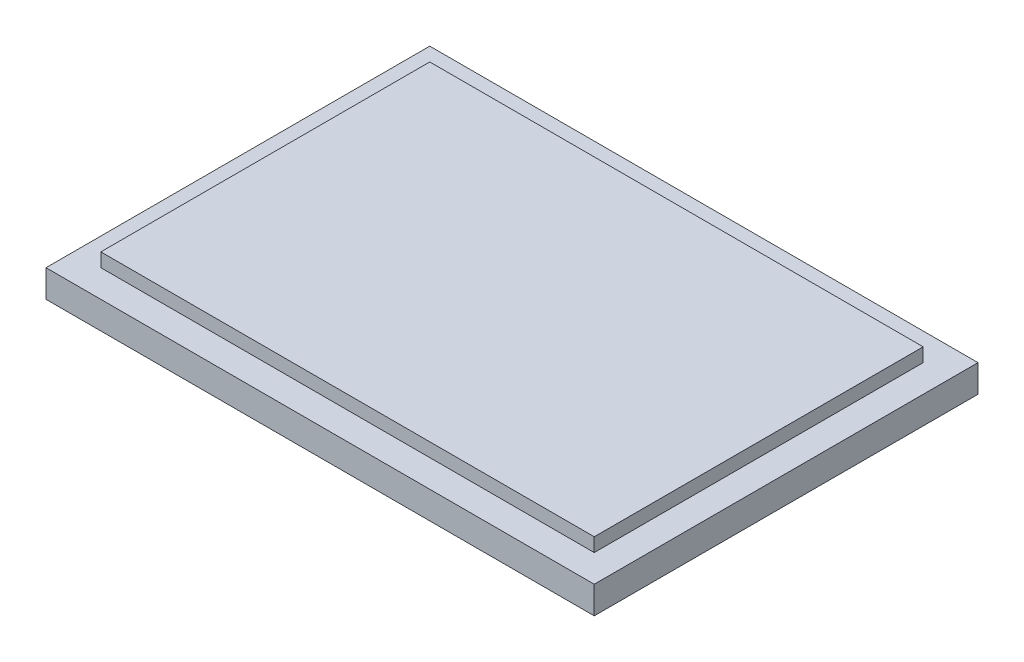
ISO-10303-21;
HEADER;
FILE_DESCRIPTION(('STEP AP214'),'2;1');
FILE_NAME('part.step','',(''),(''),'','','');
FILE_SCHEMA(('AUTOMOTIVE_DESIGN { 1 0 10303 214 1 1 1 1 }'));
ENDSEC;
DATA;
#1=APPLICATION_CONTEXT('core data for automotive mechanical design processes');
#2=APPLICATION_PROTOCOL_DEFINITION('international standard','automotive_design',2000,#1);
#3=PRODUCT_CONTEXT('',#1,'mechanical');
#4=PRODUCT('Part','Part','',(#3));
#5=PRODUCT_RELATED_PRODUCT_CATEGORY('part','',(#4));
#6=PRODUCT_DEFINITION_FORMATION('','',#4);
#7=PRODUCT_DEFINITION_CONTEXT('part definition',#1,'design');
#8=PRODUCT_DEFINITION('design','',#6,#7);
#9=PRODUCT_DEFINITION_SHAPE('','',#8);
#10=(LENGTH_UNIT() NAMED_UNIT(*) SI_UNIT(.MILLI.,.METRE.));
#11=(NAMED_UNIT(*) PLANE_ANGLE_UNIT() SI_UNIT($,.RADIAN.));
#12=(NAMED_UNIT(*) SI_UNIT($,.STERADIAN.) SOLID_ANGLE_UNIT());
#13=UNCERTAINTY_MEASURE_WITH_UNIT(LENGTH_MEASURE(1.E-05),#10,'distance_accuracy_value','');
#14=(GEOMETRIC_REPRESENTATION_CONTEXT(3) GLOBAL_UNCERTAINTY_ASSIGNED_CONTEXT((#13)) GLOBAL_UNIT_ASSIGNED_CONTEXT((#10,
#11,#12)) REPRESENTATION_CONTEXT('',''));
#15=CARTESIAN_POINT('',(0.,0.,0.));
#16=DIRECTION('',(0.,0.,1.));
#17=DIRECTION('',(1.,0.,0.));
#18=AXIS2_PLACEMENT_3D('',#15,#16,#17);
#19=CARTESIAN_POINT('',(-41.3182717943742,6.35,-25.2552133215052));
#20=DIRECTION('',(1.,0.,0.));
#21=DIRECTION('',(0.,0.,-1.));
#22=AXIS2_PLACEMENT_3D('',#19,#20,#21);
#23=PLANE('',#22);
#24=DIRECTION('',(0.,0.,1.));
#25=VECTOR('',#24,1.);
#26=CARTESIAN_POINT('',(-41.3182717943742,0.,-25.2552133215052));
#27=LINE('',#26,#25);
#28=CARTESIAN_POINT('',(-41.3182717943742,0.,-25.2552133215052));
#29=VERTEX_POINT('',#28);
#30=CARTESIAN_POINT('',(-41.3182717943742,0.,63.6447866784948));
#31=VERTEX_POINT('',#30);
#32=EDGE_CURVE('E120',#29,#31,#27,.T.);
#33=ORIENTED_EDGE('',*,*,#32,.T.);
#34=DIRECTION('',(0.,-1.,0.));
#35=VECTOR('',#34,1.);
#36=CARTESIAN_POINT('',(-41.3182717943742,6.35,63.6447866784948));
#37=LINE('',#36,#35);
#38=CARTESIAN_POINT('',(-41.3182717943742,6.35,63.6447866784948));
#39=VERTEX_POINT('',#38);
#40=EDGE_CURVE('E11',#39,#31,#37,.T.);
#41=ORIENTED_EDGE('',*,*,#40,.F.);
#42=DIRECTION('',(0.,0.,1.));
#43=VECTOR('',#42,1.);
#44=CARTESIAN_POINT('',(-41.3182717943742,6.35,-25.2552133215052));
#45=LINE('',#44,#43);
#46=CARTESIAN_POINT('',(-41.3182717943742,6.35,-25.2552133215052));
#47=VERTEX_POINT('',#46);
#48=EDGE_CURVE('E129',#47,#39,#45,.T.);
#49=ORIENTED_EDGE('',*,*,#48,.F.);
#50=DIRECTION('',(0.,-1.,0.));
#51=VECTOR('',#50,1.);
#52=CARTESIAN_POINT('',(-41.3182717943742,6.35,-25.2552133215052));
#53=LINE('',#52,#51);
#54=EDGE_CURVE('E138',#47,#29,#53,.T.);
#55=ORIENTED_EDGE('',*,*,#54,.T.);
#56=EDGE_LOOP('',(#33,#41,#49,#55));
#57=FACE_BOUND('',#56,.T.);
#58=ADVANCED_FACE('F36',(#57),#23,.F.);
#59=CARTESIAN_POINT('',(-41.3182717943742,6.35,63.6447866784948));
#60=DIRECTION('',(0.,0.,-1.));
#61=DIRECTION('',(-1.,0.,0.));
#62=AXIS2_PLACEMENT_3D('',#59,#60,#61);
#63=PLANE('',#62);
#64=DIRECTION('',(1.,0.,0.));
#65=VECTOR('',#64,1.);
#66=CARTESIAN_POINT('',(-41.3182717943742,0.,63.6447866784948));
#67=LINE('',#66,#65);
#68=CARTESIAN_POINT('',(85.6817282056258,0.,63.6447866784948));
#69=VERTEX_POINT('',#68);
#70=EDGE_CURVE('E123',#31,#69,#67,.T.);
#71=ORIENTED_EDGE('',*,*,#70,.T.);
#72=DIRECTION('',(0.,-1.,0.));
#73=VECTOR('',#72,1.);
#74=CARTESIAN_POINT('',(85.6817282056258,6.35,63.6447866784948));
#75=LINE('',#74,#73);
#76=CARTESIAN_POINT('',(85.6817282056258,6.35,63.6447866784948));
#77=VERTEX_POINT('',#76);
#78=EDGE_CURVE('E43',#77,#69,#75,.T.);
#79=ORIENTED_EDGE('',*,*,#78,.F.);
#80=DIRECTION('',(1.,0.,0.));
#81=VECTOR('',#80,1.);
#82=CARTESIAN_POINT('',(-41.3182717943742,6.35,63.6447866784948));
#83=LINE('',#82,#81);
#84=EDGE_CURVE('E132',#39,#77,#83,.T.);
#85=ORIENTED_EDGE('',*,*,#84,.F.);
#86=ORIENTED_EDGE('',*,*,#40,.T.);
#87=EDGE_LOOP('',(#71,#79,#85,#86));
#88=FACE_BOUND('',#87,.T.);
#89=ADVANCED_FACE('F169',(#88),#63,.F.);
#90=CARTESIAN_POINT('',(85.6817282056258,6.35,-25.2552133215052));
#91=DIRECTION('',(-1.,0.,0.));
#92=DIRECTION('',(0.,0.,1.));
#93=AXIS2_PLACEMENT_3D('',#90,#91,#92);
#94=PLANE('',#93);
#95=DIRECTION('',(0.,0.,-1.));
#96=VECTOR('',#95,1.);
#97=CARTESIAN_POINT('',(85.6817282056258,0.,-25.2552133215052));
#98=LINE('',#97,#96);
#99=CARTESIAN_POINT('',(85.6817282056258,0.,-25.2552133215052));
#100=VERTEX_POINT('',#99);
#101=EDGE_CURVE('E141',#69,#100,#98,.T.);
#102=ORIENTED_EDGE('',*,*,#101,.T.);
#103=DIRECTION('',(0.,-1.,0.));
#104=VECTOR('',#103,1.);
#105=CARTESIAN_POINT('',(85.6817282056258,6.35,-25.2552133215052));
#106=LINE('',#105,#104);
#107=CARTESIAN_POINT('',(85.6817282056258,6.35,-25.2552133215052));
#108=VERTEX_POINT('',#107);
#109=EDGE_CURVE('E146',#108,#100,#106,.T.);
#110=ORIENTED_EDGE('',*,*,#109,.F.);
#111=DIRECTION('',(0.,0.,-1.));
#112=VECTOR('',#111,1.);
#113=CARTESIAN_POINT('',(85.6817282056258,6.35,-25.2552133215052));
#114=LINE('',#113,#112);
#115=EDGE_CURVE('E135',#77,#108,#114,.T.);
#116=ORIENTED_EDGE('',*,*,#115,.F.);
#117=ORIENTED_EDGE('',*,*,#78,.T.);
#118=EDGE_LOOP('',(#102,#110,#116,#117));
#119=FACE_BOUND('',#118,.T.);
#120=ADVANCED_FACE('F153',(#119),#94,.F.);
#121=CARTESIAN_POINT('',(-41.3182717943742,6.35,-25.2552133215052));
#122=DIRECTION('',(0.,0.,1.));
#123=DIRECTION('',(1.,0.,0.));
#124=AXIS2_PLACEMENT_3D('',#121,#122,#123);
#125=PLANE('',#124);
#126=DIRECTION('',(-1.,0.,0.));
#127=VECTOR('',#126,1.);
#128=CARTESIAN_POINT('',(-41.3182717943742,0.,-25.2552133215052));
#129=LINE('',#128,#127);
#130=EDGE_CURVE('E133',#100,#29,#129,.T.);
#131=ORIENTED_EDGE('',*,*,#130,.T.);
#132=ORIENTED_EDGE('',*,*,#54,.F.);
#133=DIRECTION('',(-1.,0.,0.));
#134=VECTOR('',#133,1.);
#135=CARTESIAN_POINT('',(-41.3182717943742,6.35,-25.2552133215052));
#136=LINE('',#135,#134);
#137=EDGE_CURVE('E137',#108,#47,#136,.T.);
#138=ORIENTED_EDGE('',*,*,#137,.F.);
#139=ORIENTED_EDGE('',*,*,#109,.T.);
#140=EDGE_LOOP('',(#131,#132,#138,#139));
#141=FACE_BOUND('',#140,.T.);
#142=ADVANCED_FACE('F162',(#141),#125,.F.);
#143=CARTESIAN_POINT('',(0.,6.35,0.));
#144=DIRECTION('',(0.,1.,0.));
#145=DIRECTION('',(0.,0.,1.));
#146=AXIS2_PLACEMENT_3D('',#143,#144,#145);
#147=PLANE('',#146);
#148=DIRECTION('',(0.,0.,1.));
#149=VECTOR('',#148,1.);
#150=CARTESIAN_POINT('',(-34.9682717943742,6.35,-18.9052133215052));
#151=LINE('',#150,#149);
#152=CARTESIAN_POINT('',(-34.9682717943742,6.35,-18.9052133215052));
#153=VERTEX_POINT('',#152);
#154=CARTESIAN_POINT('',(-34.9682717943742,6.35,57.2947866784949));
#155=VERTEX_POINT('',#154);
#156=EDGE_CURVE('E50',#153,#155,#151,.T.);
#157=ORIENTED_EDGE('',*,*,#156,.F.);
#158=DIRECTION('',(-1.,0.,0.));
#159=VECTOR('',#158,1.);
#160=CARTESIAN_POINT('',(-34.9682717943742,6.35,-18.9052133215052));
#161=LINE('',#160,#159);
#162=CARTESIAN_POINT('',(79.3317282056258,6.35,-18.9052133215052));
#163=VERTEX_POINT('',#162);
#164=EDGE_CURVE('E54',#163,#153,#161,.T.);
#165=ORIENTED_EDGE('',*,*,#164,.F.);
#166=DIRECTION('',(0.,0.,-1.));
#167=VECTOR('',#166,1.);
#168=CARTESIAN_POINT('',(79.3317282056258,6.35,-18.9052133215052));
#169=LINE('',#168,#167);
#170=CARTESIAN_POINT('',(79.3317282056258,6.35,57.2947866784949));
#171=VERTEX_POINT('',#170);
#172=EDGE_CURVE('E285',#171,#163,#169,.T.);
#173=ORIENTED_EDGE('',*,*,#172,.F.);
#174=DIRECTION('',(1.,0.,0.));
#175=VECTOR('',#174,1.);
#176=CARTESIAN_POINT('',(-34.9682717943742,6.35,57.2947866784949));
#177=LINE('',#176,#175);
#178=EDGE_CURVE('E291',#155,#171,#177,.T.);
#179=ORIENTED_EDGE('',*,*,#178,.F.);
#180=EDGE_LOOP('',(#157,#165,#173,#179));
#181=FACE_BOUND('',#180,.T.);
#182=ORIENTED_EDGE('',*,*,#48,.T.);
#183=ORIENTED_EDGE('',*,*,#84,.T.);
#184=ORIENTED_EDGE('',*,*,#115,.T.);
#185=ORIENTED_EDGE('',*,*,#137,.T.);
#186=EDGE_LOOP('',(#182,#183,#184,#185));
#187=FACE_BOUND('',#186,.T.);
#188=ADVANCED_FACE('F168',(#181,#187),#147,.T.);
#189=CARTESIAN_POINT('',(0.,0.,0.));
#190=DIRECTION('',(0.,1.,0.));
#191=DIRECTION('',(0.,0.,1.));
#192=AXIS2_PLACEMENT_3D('',#189,#190,#191);
#193=PLANE('',#192);
#194=ORIENTED_EDGE('',*,*,#32,.F.);
#195=ORIENTED_EDGE('',*,*,#130,.F.);
#196=ORIENTED_EDGE('',*,*,#101,.F.);
#197=ORIENTED_EDGE('',*,*,#70,.F.);
#198=EDGE_LOOP('',(#194,#195,#196,#197));
#199=FACE_BOUND('',#198,.T.);
#200=ADVANCED_FACE('F159',(#199),#193,.F.);
#201=CARTESIAN_POINT('',(-34.9682717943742,9.525,-18.9052133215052));
#202=DIRECTION('',(1.,0.,0.));
#203=DIRECTION('',(0.,0.,-1.));
#204=AXIS2_PLACEMENT_3D('',#201,#202,#203);
#205=PLANE('',#204);
#206=ORIENTED_EDGE('',*,*,#156,.T.);
#207=DIRECTION('',(0.,-1.,0.));
#208=VECTOR('',#207,1.);
#209=CARTESIAN_POINT('',(-34.9682717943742,9.525,57.2947866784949));
#210=LINE('',#209,#208);
#211=CARTESIAN_POINT('',(-34.9682717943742,9.525,57.2947866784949));
#212=VERTEX_POINT('',#211);
#213=EDGE_CURVE('E103',#212,#155,#210,.T.);
#214=ORIENTED_EDGE('',*,*,#213,.F.);
#215=DIRECTION('',(0.,0.,1.));
#216=VECTOR('',#215,1.);
#217=CARTESIAN_POINT('',(-34.9682717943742,9.525,-18.9052133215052));
#218=LINE('',#217,#216);
#219=CARTESIAN_POINT('',(-34.9682717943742,9.525,-18.9052133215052));
#220=VERTEX_POINT('',#219);
#221=EDGE_CURVE('E109',#220,#212,#218,.T.);
#222=ORIENTED_EDGE('',*,*,#221,.F.);
#223=DIRECTION('',(0.,-1.,0.));
#224=VECTOR('',#223,1.);
#225=CARTESIAN_POINT('',(-34.9682717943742,9.525,-18.9052133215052));
#226=LINE('',#225,#224);
#227=EDGE_CURVE('E283',#220,#153,#226,.T.);
#228=ORIENTED_EDGE('',*,*,#227,.T.);
#229=EDGE_LOOP('',(#206,#214,#222,#228));
#230=FACE_BOUND('',#229,.T.);
#231=ADVANCED_FACE('F119',(#230),#205,.F.);
#232=CARTESIAN_POINT('',(-34.9682717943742,9.525,57.2947866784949));
#233=DIRECTION('',(0.,0.,-1.));
#234=DIRECTION('',(-1.,0.,0.));
#235=AXIS2_PLACEMENT_3D('',#232,#233,#234);
#236=PLANE('',#235);
#237=ORIENTED_EDGE('',*,*,#178,.T.);
#238=DIRECTION('',(0.,-1.,0.));
#239=VECTOR('',#238,1.);
#240=CARTESIAN_POINT('',(79.3317282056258,9.525,57.2947866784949));
#241=LINE('',#240,#239);
#242=CARTESIAN_POINT('',(79.3317282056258,9.525,57.2947866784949));
#243=VERTEX_POINT('',#242);
#244=EDGE_CURVE('E105',#243,#171,#241,.T.);
#245=ORIENTED_EDGE('',*,*,#244,.F.);
#246=DIRECTION('',(1.,0.,0.));
#247=VECTOR('',#246,1.);
#248=CARTESIAN_POINT('',(-34.9682717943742,9.525,57.2947866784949));
#249=LINE('',#248,#247);
#250=EDGE_CURVE('E98',#212,#243,#249,.T.);
#251=ORIENTED_EDGE('',*,*,#250,.F.);
#252=ORIENTED_EDGE('',*,*,#213,.T.);
#253=EDGE_LOOP('',(#237,#245,#251,#252));
#254=FACE_BOUND('',#253,.T.);
#255=ADVANCED_FACE('F101',(#254),#236,.F.);
#256=CARTESIAN_POINT('',(79.3317282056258,9.525,-18.9052133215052));
#257=DIRECTION('',(-1.,0.,0.));
#258=DIRECTION('',(0.,0.,1.));
#259=AXIS2_PLACEMENT_3D('',#256,#257,#258);
#260=PLANE('',#259);
#261=ORIENTED_EDGE('',*,*,#172,.T.);
#262=DIRECTION('',(0.,-1.,0.));
#263=VECTOR('',#262,1.);
#264=CARTESIAN_POINT('',(79.3317282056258,9.525,-18.9052133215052));
#265=LINE('',#264,#263);
#266=CARTESIAN_POINT('',(79.3317282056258,9.525,-18.9052133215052));
#267=VERTEX_POINT('',#266);
#268=EDGE_CURVE('E125',#267,#163,#265,.T.);
#269=ORIENTED_EDGE('',*,*,#268,.F.);
#270=DIRECTION('',(0.,0.,-1.));
#271=VECTOR('',#270,1.);
#272=CARTESIAN_POINT('',(79.3317282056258,9.525,-18.9052133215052));
#273=LINE('',#272,#271);
#274=EDGE_CURVE('E108',#243,#267,#273,.T.);
#275=ORIENTED_EDGE('',*,*,#274,.F.);
#276=ORIENTED_EDGE('',*,*,#244,.T.);
#277=EDGE_LOOP('',(#261,#269,#275,#276));
#278=FACE_BOUND('',#277,.T.);
#279=ADVANCED_FACE('F187',(#278),#260,.F.);
#280=CARTESIAN_POINT('',(-34.9682717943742,9.525,-18.9052133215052));
#281=DIRECTION('',(0.,0.,1.));
#282=DIRECTION('',(1.,0.,0.));
#283=AXIS2_PLACEMENT_3D('',#280,#281,#282);
#284=PLANE('',#283);
#285=ORIENTED_EDGE('',*,*,#164,.T.);
#286=ORIENTED_EDGE('',*,*,#227,.F.);
#287=DIRECTION('',(-1.,0.,0.));
#288=VECTOR('',#287,1.);
#289=CARTESIAN_POINT('',(-34.9682717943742,9.525,-18.9052133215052));
#290=LINE('',#289,#288);
#291=EDGE_CURVE('E114',#267,#220,#290,.T.);
#292=ORIENTED_EDGE('',*,*,#291,.F.);
#293=ORIENTED_EDGE('',*,*,#268,.T.);
#294=EDGE_LOOP('',(#285,#286,#292,#293));
#295=FACE_BOUND('',#294,.T.);
#296=ADVANCED_FACE('F190',(#295),#284,.F.);
#297=CARTESIAN_POINT('',(0.,9.525,0.));
#298=DIRECTION('',(0.,1.,0.));
#299=DIRECTION('',(0.,0.,1.));
#300=AXIS2_PLACEMENT_3D('',#297,#298,#299);
#301=PLANE('',#300);
#302=ORIENTED_EDGE('',*,*,#221,.T.);
#303=ORIENTED_EDGE('',*,*,#250,.T.);
#304=ORIENTED_EDGE('',*,*,#274,.T.);
#305=ORIENTED_EDGE('',*,*,#291,.T.);
#306=EDGE_LOOP('',(#302,#303,#304,#305));
#307=FACE_BOUND('',#306,.T.);
#308=ADVANCED_FACE('F112',(#307),#301,.T.);
#309=CLOSED_SHELL('',(#58,#89,#120,#142,#188,#200,#231,#255,#279,#296,#308));
#310=MANIFOLD_SOLID_BREP('B2',#309);
#311=ADVANCED_BREP_SHAPE_REPRESENTATION('',(#18,#310),#14);
#312=SHAPE_DEFINITION_REPRESENTATION(#9,#311);
ENDSEC;
END-ISO-10303-21;
